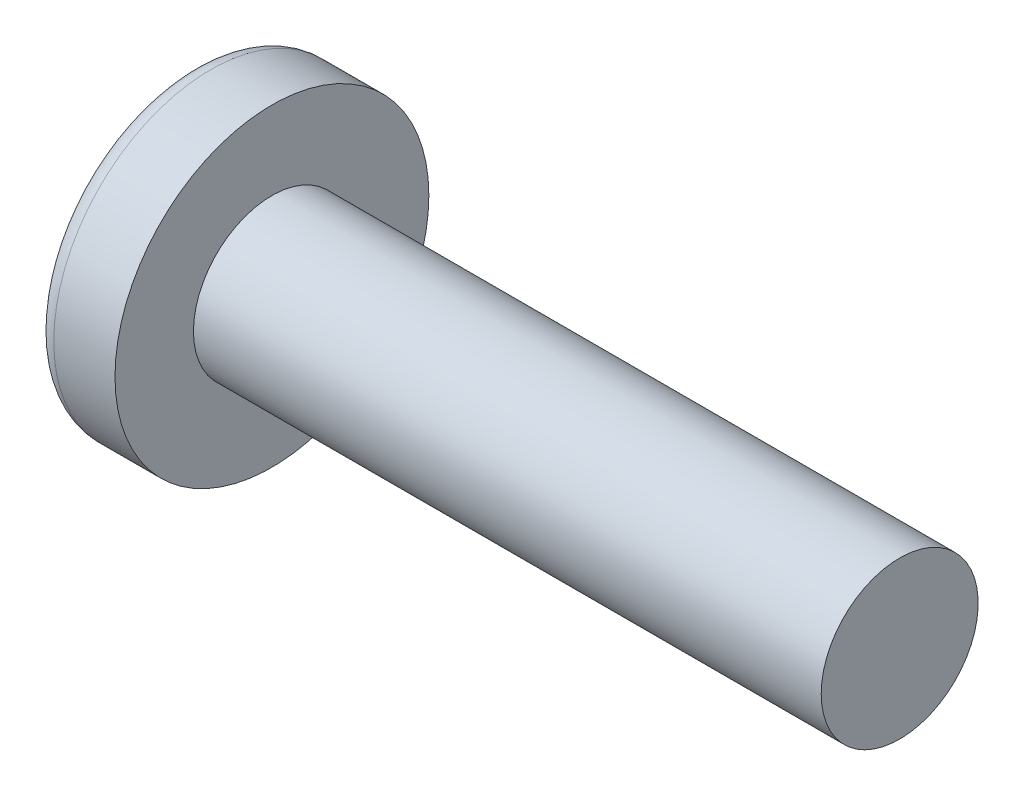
ISO-10303-21;
HEADER;
FILE_DESCRIPTION(('STEP AP214'),'2;1');
FILE_NAME('part.step','',(''),(''),'','','');
FILE_SCHEMA(('AUTOMOTIVE_DESIGN { 1 0 10303 214 1 1 1 1 }'));
ENDSEC;
DATA;
#1=APPLICATION_CONTEXT('core data for automotive mechanical design processes');
#2=APPLICATION_PROTOCOL_DEFINITION('international standard','automotive_design',2000,#1);
#3=PRODUCT_CONTEXT('',#1,'mechanical');
#4=PRODUCT('Part','Part','',(#3));
#5=PRODUCT_RELATED_PRODUCT_CATEGORY('part','',(#4));
#6=PRODUCT_DEFINITION_FORMATION('','',#4);
#7=PRODUCT_DEFINITION_CONTEXT('part definition',#1,'design');
#8=PRODUCT_DEFINITION('design','',#6,#7);
#9=PRODUCT_DEFINITION_SHAPE('','',#8);
#10=(LENGTH_UNIT() NAMED_UNIT(*) SI_UNIT(.MILLI.,.METRE.));
#11=(NAMED_UNIT(*) PLANE_ANGLE_UNIT() SI_UNIT($,.RADIAN.));
#12=(NAMED_UNIT(*) SI_UNIT($,.STERADIAN.) SOLID_ANGLE_UNIT());
#13=UNCERTAINTY_MEASURE_WITH_UNIT(LENGTH_MEASURE(1.E-05),#10,'distance_accuracy_value','');
#14=(GEOMETRIC_REPRESENTATION_CONTEXT(3) GLOBAL_UNCERTAINTY_ASSIGNED_CONTEXT((#13)) GLOBAL_UNIT_ASSIGNED_CONTEXT((#10,
#11,#12)) REPRESENTATION_CONTEXT('',''));
#15=CARTESIAN_POINT('',(0.,0.,0.));
#16=DIRECTION('',(0.,0.,1.));
#17=DIRECTION('',(1.,0.,0.));
#18=AXIS2_PLACEMENT_3D('',#15,#16,#17);
#19=CARTESIAN_POINT('',(3.2,0.,0.));
#20=DIRECTION('',(-1.,0.,0.));
#21=DIRECTION('',(0.,1.,0.));
#22=AXIS2_PLACEMENT_3D('',#19,#20,#21);
#23=SPHERICAL_SURFACE('',#22,3.2);
#24=CARTESIAN_POINT('',(0.627117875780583,0.,0.));
#25=DIRECTION('',(-1.,0.,0.));
#26=DIRECTION('',(0.,0.,1.));
#27=AXIS2_PLACEMENT_3D('',#24,#25,#26);
#28=CIRCLE('',#27,1.9027027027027);
#29=CARTESIAN_POINT('',(0.627117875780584,0.,1.90270270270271));
#30=VERTEX_POINT('',#29);
#31=EDGE_CURVE('E136',#30,#30,#28,.T.);
#32=ORIENTED_EDGE('',*,*,#31,.T.);
#33=EDGE_LOOP('',(#32));
#34=FACE_BOUND('',#33,.T.);
#35=CARTESIAN_POINT('',(3.19174554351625,-0.0818566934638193,-1.38777878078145E-13));
#36=DIRECTION('',(-0.100331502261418,-0.994954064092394,0.));
#37=DIRECTION('',(0.994954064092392,-0.100331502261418,0.));
#38=AXIS2_PLACEMENT_3D('',#35,#36,#37);
#39=CIRCLE('',#38,3.1989422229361);
#40=CARTESIAN_POINT('',(0.118330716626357,0.228067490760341,0.831444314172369));
#41=VERTEX_POINT('',#40);
#42=CARTESIAN_POINT('',(0.017781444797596,0.238206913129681,0.238206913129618));
#43=VERTEX_POINT('',#42);
#44=EDGE_CURVE('E167',#41,#43,#39,.T.);
#45=ORIENTED_EDGE('',*,*,#44,.F.);
#46=CARTESIAN_POINT('',(2.64043280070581,0.,-0.842892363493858));
#47=DIRECTION('',(0.553083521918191,0.,0.833125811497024));
#48=DIRECTION('',(0.833125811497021,0.,-0.553083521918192));
#49=AXIS2_PLACEMENT_3D('',#46,#47,#48);
#50=CIRCLE('',#49,3.03585523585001);
#51=CARTESIAN_POINT('',(0.118330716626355,-0.228067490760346,0.831444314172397));
#52=VERTEX_POINT('',#51);
#53=EDGE_CURVE('E132',#41,#52,#50,.T.);
#54=ORIENTED_EDGE('',*,*,#53,.T.);
#55=CARTESIAN_POINT('',(3.19174554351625,0.0818566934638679,0.));
#56=DIRECTION('',(-0.100331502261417,0.994954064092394,0.));
#57=DIRECTION('',(-0.994954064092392,-0.100331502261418,0.));
#58=AXIS2_PLACEMENT_3D('',#55,#56,#57);
#59=CIRCLE('',#58,3.1989422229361);
#60=CARTESIAN_POINT('',(0.0177814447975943,-0.238206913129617,0.238206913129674));
#61=VERTEX_POINT('',#60);
#62=EDGE_CURVE('E88',#61,#52,#59,.T.);
#63=ORIENTED_EDGE('',*,*,#62,.F.);
#64=CARTESIAN_POINT('',(3.19174554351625,0.,-0.0818566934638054));
#65=DIRECTION('',(-0.100331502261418,0.,-0.994954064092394));
#66=DIRECTION('',(-0.994954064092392,0.,0.100331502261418));
#67=AXIS2_PLACEMENT_3D('',#64,#65,#66);
#68=CIRCLE('',#67,3.1989422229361);
#69=CARTESIAN_POINT('',(0.118330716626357,-0.831444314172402,0.228067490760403));
#70=VERTEX_POINT('',#69);
#71=EDGE_CURVE('E113',#70,#61,#68,.T.);
#72=ORIENTED_EDGE('',*,*,#71,.F.);
#73=CARTESIAN_POINT('',(2.64043280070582,0.842892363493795,0.));
#74=DIRECTION('',(0.553083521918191,-0.833125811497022,0.));
#75=DIRECTION('',(0.833125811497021,0.553083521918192,0.));
#76=AXIS2_PLACEMENT_3D('',#73,#74,#75);
#77=CIRCLE('',#76,3.03585523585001);
#78=CARTESIAN_POINT('',(0.118330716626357,-0.831444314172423,-0.228067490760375));
#79=VERTEX_POINT('',#78);
#80=EDGE_CURVE('E121',#70,#79,#77,.T.);
#81=ORIENTED_EDGE('',*,*,#80,.T.);
#82=CARTESIAN_POINT('',(3.19174554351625,0.,0.0818566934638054));
#83=DIRECTION('',(-0.100331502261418,0.,0.994954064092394));
#84=DIRECTION('',(0.994954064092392,0.,0.100331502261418));
#85=AXIS2_PLACEMENT_3D('',#82,#83,#84);
#86=CIRCLE('',#85,3.1989422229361);
#87=CARTESIAN_POINT('',(0.017781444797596,-0.23820691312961,-0.238206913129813));
#88=VERTEX_POINT('',#87);
#89=EDGE_CURVE('E31',#88,#79,#86,.T.);
#90=ORIENTED_EDGE('',*,*,#89,.F.);
#91=CARTESIAN_POINT('',(0.118330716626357,-0.228067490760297,-0.831444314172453));
#92=VERTEX_POINT('',#91);
#93=EDGE_CURVE('E174',#92,#88,#59,.T.);
#94=ORIENTED_EDGE('',*,*,#93,.F.);
#95=CARTESIAN_POINT('',(2.64043280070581,0.,0.842892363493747));
#96=DIRECTION('',(0.553083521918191,0.,-0.833125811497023));
#97=DIRECTION('',(-0.833125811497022,0.,-0.553083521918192));
#98=AXIS2_PLACEMENT_3D('',#95,#96,#97);
#99=CIRCLE('',#98,3.03585523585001);
#100=CARTESIAN_POINT('',(0.118330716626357,0.228067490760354,-0.831444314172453));
#101=VERTEX_POINT('',#100);
#102=EDGE_CURVE('E114',#92,#101,#99,.T.);
#103=ORIENTED_EDGE('',*,*,#102,.T.);
#104=CARTESIAN_POINT('',(0.0177814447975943,0.238206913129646,-0.238206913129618));
#105=VERTEX_POINT('',#104);
#106=EDGE_CURVE('E162',#105,#101,#39,.T.);
#107=ORIENTED_EDGE('',*,*,#106,.F.);
#108=CARTESIAN_POINT('',(0.118330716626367,0.831444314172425,-0.228067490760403));
#109=VERTEX_POINT('',#108);
#110=EDGE_CURVE('E24',#109,#105,#86,.T.);
#111=ORIENTED_EDGE('',*,*,#110,.F.);
#112=CARTESIAN_POINT('',(2.64043280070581,-0.842892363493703,0.));
#113=DIRECTION('',(0.553083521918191,0.833125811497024,0.));
#114=DIRECTION('',(-0.833125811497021,0.553083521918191,0.));
#115=AXIS2_PLACEMENT_3D('',#112,#113,#114);
#116=CIRCLE('',#115,3.03585523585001);
#117=CARTESIAN_POINT('',(0.118330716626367,0.831444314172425,0.228067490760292));
#118=VERTEX_POINT('',#117);
#119=EDGE_CURVE('E11',#109,#118,#116,.T.);
#120=ORIENTED_EDGE('',*,*,#119,.T.);
#121=EDGE_CURVE('E150',#43,#118,#68,.T.);
#122=ORIENTED_EDGE('',*,*,#121,.F.);
#123=EDGE_LOOP('',(#45,#54,#63,#72,#81,#90,#94,#103,#107,#111,#120,#122));
#124=FACE_BOUND('',#123,.T.);
#125=ADVANCED_FACE('F16',(#34,#124),#23,.T.);
#126=CARTESIAN_POINT('',(1.37075949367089,0.,-0.101772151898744));
#127=DIRECTION('',(-0.100331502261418,0.,0.994954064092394));
#128=DIRECTION('',(0.994954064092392,0.,0.100331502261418));
#129=AXIS2_PLACEMENT_3D('',#126,#127,#128);
#130=PLANE('',#129);
#131=ORIENTED_EDGE('',*,*,#110,.T.);
#132=DIRECTION('',(0.989983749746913,-0.0998302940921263,0.099830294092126));
#133=VECTOR('',#132,1.);
#134=CARTESIAN_POINT('',(1.38081767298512,0.100757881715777,-0.100757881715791));
#135=LINE('',#134,#133);
#136=CARTESIAN_POINT('',(1.19,0.120000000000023,-0.119999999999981));
#137=VERTEX_POINT('',#136);
#138=EDGE_CURVE('E156',#105,#137,#135,.T.);
#139=ORIENTED_EDGE('',*,*,#138,.T.);
#140=DIRECTION('',(0.830201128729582,-0.55114192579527,0.083717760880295));
#141=VECTOR('',#140,1.);
#142=CARTESIAN_POINT('',(0.,0.90999999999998,-0.23999999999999));
#143=LINE('',#142,#141);
#144=EDGE_CURVE('E137',#109,#137,#143,.T.);
#145=ORIENTED_EDGE('',*,*,#144,.F.);
#146=EDGE_LOOP('',(#131,#139,#145));
#147=FACE_BOUND('',#146,.T.);
#148=ADVANCED_FACE('F155',(#147),#130,.T.);
#149=DIRECTION('',(0.830201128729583,0.55114192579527,0.0837177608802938));
#150=VECTOR('',#149,1.);
#151=CARTESIAN_POINT('',(0.,-0.909999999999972,-0.240000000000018));
#152=LINE('',#151,#150);
#153=CARTESIAN_POINT('',(1.19,-0.119999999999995,-0.120000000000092));
#154=VERTEX_POINT('',#153);
#155=EDGE_CURVE('E122',#79,#154,#152,.T.);
#156=ORIENTED_EDGE('',*,*,#155,.T.);
#157=DIRECTION('',(-0.989983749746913,-0.0998302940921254,-0.0998302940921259));
#158=VECTOR('',#157,1.);
#159=CARTESIAN_POINT('',(1.38081767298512,-0.10075788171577,-0.100757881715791));
#160=LINE('',#159,#158);
#161=EDGE_CURVE('E177',#154,#88,#160,.T.);
#162=ORIENTED_EDGE('',*,*,#161,.T.);
#163=ORIENTED_EDGE('',*,*,#89,.T.);
#164=EDGE_LOOP('',(#156,#162,#163));
#165=FACE_BOUND('',#164,.T.);
#166=ADVANCED_FACE('F192',(#165),#130,.T.);
#167=CARTESIAN_POINT('',(1.37075949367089,0.,0.101772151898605));
#168=DIRECTION('',(-0.100331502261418,0.,-0.994954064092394));
#169=DIRECTION('',(-0.994954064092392,0.,0.100331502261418));
#170=AXIS2_PLACEMENT_3D('',#167,#168,#169);
#171=PLANE('',#170);
#172=DIRECTION('',(0.830201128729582,-0.551141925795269,-0.0837177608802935));
#173=VECTOR('',#172,1.);
#174=CARTESIAN_POINT('',(0.,0.909999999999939,0.23999999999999));
#175=LINE('',#174,#173);
#176=CARTESIAN_POINT('',(1.19,0.120000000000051,0.119999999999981));
#177=VERTEX_POINT('',#176);
#178=EDGE_CURVE('E193',#118,#177,#175,.T.);
#179=ORIENTED_EDGE('',*,*,#178,.T.);
#180=DIRECTION('',(-0.989983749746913,0.0998302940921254,0.0998302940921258));
#181=VECTOR('',#180,1.);
#182=CARTESIAN_POINT('',(1.38081767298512,0.100757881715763,0.100757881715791));
#183=LINE('',#182,#181);
#184=EDGE_CURVE('E171',#177,#43,#183,.T.);
#185=ORIENTED_EDGE('',*,*,#184,.T.);
#186=ORIENTED_EDGE('',*,*,#121,.T.);
#187=EDGE_LOOP('',(#179,#185,#186));
#188=FACE_BOUND('',#187,.T.);
#189=ADVANCED_FACE('F197',(#188),#171,.T.);
#190=ORIENTED_EDGE('',*,*,#71,.T.);
#191=DIRECTION('',(0.989983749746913,0.0998302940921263,-0.0998302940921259));
#192=VECTOR('',#191,1.);
#193=CARTESIAN_POINT('',(1.38081767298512,-0.100757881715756,0.100757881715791));
#194=LINE('',#193,#192);
#195=CARTESIAN_POINT('',(1.19,-0.120000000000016,0.119999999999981));
#196=VERTEX_POINT('',#195);
#197=EDGE_CURVE('E86',#61,#196,#194,.T.);
#198=ORIENTED_EDGE('',*,*,#197,.T.);
#199=DIRECTION('',(0.830201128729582,0.55114192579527,-0.0837177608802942));
#200=VECTOR('',#199,1.);
#201=CARTESIAN_POINT('',(0.,-0.910000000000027,0.239999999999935));
#202=LINE('',#201,#200);
#203=EDGE_CURVE('E111',#70,#196,#202,.T.);
#204=ORIENTED_EDGE('',*,*,#203,.F.);
#205=EDGE_LOOP('',(#190,#198,#204));
#206=FACE_BOUND('',#205,.T.);
#207=ADVANCED_FACE('F110',(#206),#171,.T.);
#208=CARTESIAN_POINT('',(-25.4,0.,0.));
#209=DIRECTION('',(-1.,0.,0.));
#210=DIRECTION('',(0.,0.,1.));
#211=AXIS2_PLACEMENT_3D('',#208,#209,#210);
#212=CYLINDRICAL_SURFACE('',#211,1.);
#213=CARTESIAN_POINT('',(9.6,0.,0.));
#214=DIRECTION('',(-1.,0.,0.));
#215=DIRECTION('',(0.,0.,1.));
#216=AXIS2_PLACEMENT_3D('',#213,#214,#215);
#217=CIRCLE('',#216,1.);
#218=CARTESIAN_POINT('',(9.6,0.,1.));
#219=VERTEX_POINT('',#218);
#220=EDGE_CURVE('E133',#219,#219,#217,.T.);
#221=ORIENTED_EDGE('',*,*,#220,.T.);
#222=EDGE_LOOP('',(#221));
#223=FACE_BOUND('',#222,.T.);
#224=CARTESIAN_POINT('',(1.6,0.,0.));
#225=DIRECTION('',(-1.,0.,0.));
#226=DIRECTION('',(0.,0.,1.));
#227=AXIS2_PLACEMENT_3D('',#224,#225,#226);
#228=CIRCLE('',#227,1.);
#229=CARTESIAN_POINT('',(1.6,0.,1.));
#230=VERTEX_POINT('',#229);
#231=EDGE_CURVE('E146',#230,#230,#228,.T.);
#232=ORIENTED_EDGE('',*,*,#231,.F.);
#233=EDGE_LOOP('',(#232));
#234=FACE_BOUND('',#233,.T.);
#235=ADVANCED_FACE('F18',(#223,#234),#212,.T.);
#236=CARTESIAN_POINT('',(1.60000000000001,1.00000000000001,0.));
#237=DIRECTION('',(-1.,0.,0.));
#238=DIRECTION('',(0.,0.,1.));
#239=AXIS2_PLACEMENT_3D('',#236,#237,#238);
#240=PLANE('',#239);
#241=CARTESIAN_POINT('',(1.6,0.,0.));
#242=DIRECTION('',(-1.,0.,0.));
#243=DIRECTION('',(0.,0.,1.));
#244=AXIS2_PLACEMENT_3D('',#241,#242,#243);
#245=CIRCLE('',#244,2.);
#246=CARTESIAN_POINT('',(1.6,0.,2.));
#247=VERTEX_POINT('',#246);
#248=EDGE_CURVE('E143',#247,#247,#245,.T.);
#249=ORIENTED_EDGE('',*,*,#248,.F.);
#250=EDGE_LOOP('',(#249));
#251=FACE_BOUND('',#250,.T.);
#252=ORIENTED_EDGE('',*,*,#231,.T.);
#253=EDGE_LOOP('',(#252));
#254=FACE_BOUND('',#253,.T.);
#255=ADVANCED_FACE('F226',(#251,#254),#240,.F.);
#256=CARTESIAN_POINT('',(-25.4,0.,0.));
#257=DIRECTION('',(-1.,0.,0.));
#258=DIRECTION('',(0.,0.,1.));
#259=AXIS2_PLACEMENT_3D('',#256,#257,#258);
#260=CYLINDRICAL_SURFACE('',#259,2.);
#261=ORIENTED_EDGE('',*,*,#248,.T.);
#262=EDGE_LOOP('',(#261));
#263=FACE_BOUND('',#262,.T.);
#264=CARTESIAN_POINT('',(0.820084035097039,0.,0.));
#265=DIRECTION('',(-1.,0.,0.));
#266=DIRECTION('',(0.,0.,1.));
#267=AXIS2_PLACEMENT_3D('',#264,#265,#266);
#268=CIRCLE('',#267,2.);
#269=CARTESIAN_POINT('',(0.820084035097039,0.,2.));
#270=VERTEX_POINT('',#269);
#271=EDGE_CURVE('E140',#270,#270,#268,.T.);
#272=ORIENTED_EDGE('',*,*,#271,.F.);
#273=EDGE_LOOP('',(#272));
#274=FACE_BOUND('',#273,.T.);
#275=ADVANCED_FACE('F223',(#263,#274),#260,.T.);
#276=CARTESIAN_POINT('',(0.820084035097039,0.,0.));
#277=DIRECTION('',(-1.,0.,0.));
#278=DIRECTION('',(0.,0.,1.));
#279=AXIS2_PLACEMENT_3D('',#276,#277,#278);
#280=TOROIDAL_SURFACE('',#279,1.76,0.24);
#281=ORIENTED_EDGE('',*,*,#271,.T.);
#282=EDGE_LOOP('',(#281));
#283=FACE_BOUND('',#282,.T.);
#284=ORIENTED_EDGE('',*,*,#31,.F.);
#285=EDGE_LOOP('',(#284));
#286=FACE_BOUND('',#285,.T.);
#287=ADVANCED_FACE('F220',(#283,#286),#280,.T.);
#288=CARTESIAN_POINT('',(9.6,1.00000000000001,0.));
#289=DIRECTION('',(1.,0.,0.));
#290=DIRECTION('',(0.,0.,-1.));
#291=AXIS2_PLACEMENT_3D('',#288,#289,#290);
#292=PLANE('',#291);
#293=ORIENTED_EDGE('',*,*,#220,.F.);
#294=EDGE_LOOP('',(#293));
#295=FACE_BOUND('',#294,.T.);
#296=ADVANCED_FACE('F218',(#295),#292,.T.);
#297=CARTESIAN_POINT('',(1.19,0.120000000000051,0.119999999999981));
#298=DIRECTION('',(0.553083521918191,0.833125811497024,0.));
#299=DIRECTION('',(-0.833125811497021,0.553083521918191,0.));
#300=AXIS2_PLACEMENT_3D('',#297,#298,#299);
#301=PLANE('',#300);
#302=ORIENTED_EDGE('',*,*,#144,.T.);
#303=DIRECTION('',(0.,0.,-1.));
#304=VECTOR('',#303,1.);
#305=CARTESIAN_POINT('',(1.19,0.120000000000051,0.119999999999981));
#306=LINE('',#305,#304);
#307=EDGE_CURVE('E104',#177,#137,#306,.T.);
#308=ORIENTED_EDGE('',*,*,#307,.F.);
#309=ORIENTED_EDGE('',*,*,#178,.F.);
#310=ORIENTED_EDGE('',*,*,#119,.F.);
#311=EDGE_LOOP('',(#302,#308,#309,#310));
#312=FACE_BOUND('',#311,.T.);
#313=ADVANCED_FACE('F196',(#312),#301,.F.);
#314=CARTESIAN_POINT('',(0.,-0.909999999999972,-0.240000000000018));
#315=DIRECTION('',(0.553083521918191,-0.833125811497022,0.));
#316=DIRECTION('',(0.833125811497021,0.553083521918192,0.));
#317=AXIS2_PLACEMENT_3D('',#314,#315,#316);
#318=PLANE('',#317);
#319=ORIENTED_EDGE('',*,*,#203,.T.);
#320=DIRECTION('',(0.,0.,1.));
#321=VECTOR('',#320,1.);
#322=CARTESIAN_POINT('',(1.19,-0.119999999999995,-0.120000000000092));
#323=LINE('',#322,#321);
#324=EDGE_CURVE('E103',#154,#196,#323,.T.);
#325=ORIENTED_EDGE('',*,*,#324,.F.);
#326=ORIENTED_EDGE('',*,*,#155,.F.);
#327=ORIENTED_EDGE('',*,*,#80,.F.);
#328=EDGE_LOOP('',(#319,#325,#326,#327));
#329=FACE_BOUND('',#328,.T.);
#330=ADVANCED_FACE('F118',(#329),#318,.F.);
#331=CARTESIAN_POINT('',(1.19,0.120000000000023,-0.119999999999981));
#332=DIRECTION('',(-1.,0.,0.));
#333=DIRECTION('',(0.,0.,1.));
#334=AXIS2_PLACEMENT_3D('',#331,#332,#333);
#335=PLANE('',#334);
#336=DIRECTION('',(0.,1.,0.));
#337=VECTOR('',#336,1.);
#338=CARTESIAN_POINT('',(1.19,-0.119999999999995,-0.120000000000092));
#339=LINE('',#338,#337);
#340=EDGE_CURVE('E126',#154,#137,#339,.T.);
#341=ORIENTED_EDGE('',*,*,#340,.F.);
#342=ORIENTED_EDGE('',*,*,#324,.T.);
#343=DIRECTION('',(0.,-1.,0.));
#344=VECTOR('',#343,1.);
#345=CARTESIAN_POINT('',(1.19,0.120000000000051,0.119999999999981));
#346=LINE('',#345,#344);
#347=EDGE_CURVE('E95',#177,#196,#346,.T.);
#348=ORIENTED_EDGE('',*,*,#347,.F.);
#349=ORIENTED_EDGE('',*,*,#307,.T.);
#350=EDGE_LOOP('',(#341,#342,#348,#349));
#351=FACE_BOUND('',#350,.T.);
#352=ADVANCED_FACE('F124',(#351),#335,.T.);
#353=CARTESIAN_POINT('',(0.,0.239999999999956,-0.91000000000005));
#354=DIRECTION('',(0.553083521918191,0.,-0.833125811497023));
#355=DIRECTION('',(0.833125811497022,0.,0.553083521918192));
#356=AXIS2_PLACEMENT_3D('',#353,#354,#355);
#357=PLANE('',#356);
#358=DIRECTION('',(0.830201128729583,0.0837177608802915,0.551141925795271));
#359=VECTOR('',#358,1.);
#360=CARTESIAN_POINT('',(0.,-0.239999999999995,-0.910000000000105));
#361=LINE('',#360,#359);
#362=EDGE_CURVE('E182',#92,#154,#361,.T.);
#363=ORIENTED_EDGE('',*,*,#362,.T.);
#364=ORIENTED_EDGE('',*,*,#340,.T.);
#365=DIRECTION('',(0.830201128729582,-0.0837177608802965,0.55114192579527));
#366=VECTOR('',#365,1.);
#367=CARTESIAN_POINT('',(0.,0.239999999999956,-0.91000000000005));
#368=LINE('',#367,#366);
#369=EDGE_CURVE('E92',#101,#137,#368,.T.);
#370=ORIENTED_EDGE('',*,*,#369,.F.);
#371=ORIENTED_EDGE('',*,*,#102,.F.);
#372=EDGE_LOOP('',(#363,#364,#370,#371));
#373=FACE_BOUND('',#372,.T.);
#374=ADVANCED_FACE('F187',(#373),#357,.F.);
#375=CARTESIAN_POINT('',(1.37075949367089,-0.101772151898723,0.));
#376=DIRECTION('',(-0.100331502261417,0.994954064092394,0.));
#377=DIRECTION('',(-0.994954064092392,-0.100331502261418,0.));
#378=AXIS2_PLACEMENT_3D('',#375,#376,#377);
#379=PLANE('',#378);
#380=ORIENTED_EDGE('',*,*,#93,.T.);
#381=ORIENTED_EDGE('',*,*,#161,.F.);
#382=ORIENTED_EDGE('',*,*,#362,.F.);
#383=EDGE_LOOP('',(#380,#381,#382));
#384=FACE_BOUND('',#383,.T.);
#385=ADVANCED_FACE('F191',(#384),#379,.T.);
#386=CARTESIAN_POINT('',(1.37075949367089,0.101772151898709,0.));
#387=DIRECTION('',(-0.100331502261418,-0.994954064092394,0.));
#388=DIRECTION('',(0.994954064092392,-0.100331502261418,0.));
#389=AXIS2_PLACEMENT_3D('',#386,#387,#388);
#390=PLANE('',#389);
#391=ORIENTED_EDGE('',*,*,#106,.T.);
#392=ORIENTED_EDGE('',*,*,#369,.T.);
#393=ORIENTED_EDGE('',*,*,#138,.F.);
#394=EDGE_LOOP('',(#391,#392,#393));
#395=FACE_BOUND('',#394,.T.);
#396=ADVANCED_FACE('F185',(#395),#390,.T.);
#397=CARTESIAN_POINT('',(1.19,-0.120000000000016,0.119999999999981));
#398=DIRECTION('',(0.553083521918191,0.,0.833125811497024));
#399=DIRECTION('',(-0.833125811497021,0.,0.553083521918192));
#400=AXIS2_PLACEMENT_3D('',#397,#398,#399);
#401=PLANE('',#400);
#402=DIRECTION('',(0.830201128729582,-0.0837177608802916,-0.551141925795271));
#403=VECTOR('',#402,1.);
#404=CARTESIAN_POINT('',(0.,0.240000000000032,0.909999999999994));
#405=LINE('',#404,#403);
#406=EDGE_CURVE('E91',#41,#177,#405,.T.);
#407=ORIENTED_EDGE('',*,*,#406,.T.);
#408=ORIENTED_EDGE('',*,*,#347,.T.);
#409=DIRECTION('',(0.830201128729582,0.0837177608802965,-0.55114192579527));
#410=VECTOR('',#409,1.);
#411=CARTESIAN_POINT('',(0.,-0.239999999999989,0.909999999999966));
#412=LINE('',#411,#410);
#413=EDGE_CURVE('E82',#52,#196,#412,.T.);
#414=ORIENTED_EDGE('',*,*,#413,.F.);
#415=ORIENTED_EDGE('',*,*,#53,.F.);
#416=EDGE_LOOP('',(#407,#408,#414,#415));
#417=FACE_BOUND('',#416,.T.);
#418=ADVANCED_FACE('F96',(#417),#401,.F.);
#419=ORIENTED_EDGE('',*,*,#44,.T.);
#420=ORIENTED_EDGE('',*,*,#184,.F.);
#421=ORIENTED_EDGE('',*,*,#406,.F.);
#422=EDGE_LOOP('',(#419,#420,#421));
#423=FACE_BOUND('',#422,.T.);
#424=ADVANCED_FACE('F198',(#423),#390,.T.);
#425=ORIENTED_EDGE('',*,*,#62,.T.);
#426=ORIENTED_EDGE('',*,*,#413,.T.);
#427=ORIENTED_EDGE('',*,*,#197,.F.);
#428=EDGE_LOOP('',(#425,#426,#427));
#429=FACE_BOUND('',#428,.T.);
#430=ADVANCED_FACE('F84',(#429),#379,.T.);
#431=CLOSED_SHELL('',(#125,#148,#166,#189,#207,#235,#255,#275,#287,#296,#313,#330,#352,#374,
#385,#396,#418,#424,#430));
#432=MANIFOLD_SOLID_BREP('B1',#431);
#433=ADVANCED_BREP_SHAPE_REPRESENTATION('',(#18,#432),#14);
#434=SHAPE_DEFINITION_REPRESENTATION(#9,#433);
ENDSEC;
END-ISO-10303-21;
